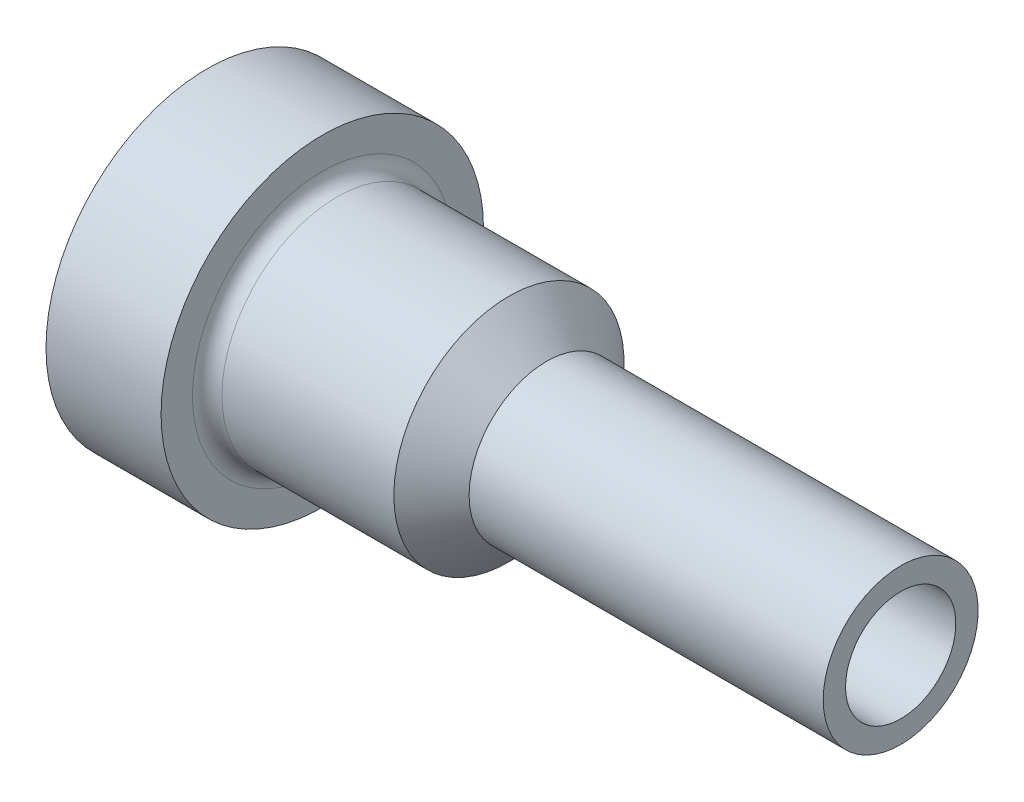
ISO-10303-21;
HEADER;
FILE_DESCRIPTION(('STEP AP214'),'2;1');
FILE_NAME('part.step','',(''),(''),'','','');
FILE_SCHEMA(('AUTOMOTIVE_DESIGN { 1 0 10303 214 1 1 1 1 }'));
ENDSEC;
DATA;
#1=APPLICATION_CONTEXT('core data for automotive mechanical design processes');
#2=APPLICATION_PROTOCOL_DEFINITION('international standard','automotive_design',2000,#1);
#3=PRODUCT_CONTEXT('',#1,'mechanical');
#4=PRODUCT('Part','Part','',(#3));
#5=PRODUCT_RELATED_PRODUCT_CATEGORY('part','',(#4));
#6=PRODUCT_DEFINITION_FORMATION('','',#4);
#7=PRODUCT_DEFINITION_CONTEXT('part definition',#1,'design');
#8=PRODUCT_DEFINITION('design','',#6,#7);
#9=PRODUCT_DEFINITION_SHAPE('','',#8);
#10=(LENGTH_UNIT() NAMED_UNIT(*) SI_UNIT(.MILLI.,.METRE.));
#11=(NAMED_UNIT(*) PLANE_ANGLE_UNIT() SI_UNIT($,.RADIAN.));
#12=(NAMED_UNIT(*) SI_UNIT($,.STERADIAN.) SOLID_ANGLE_UNIT());
#13=UNCERTAINTY_MEASURE_WITH_UNIT(LENGTH_MEASURE(1.E-05),#10,'distance_accuracy_value','');
#14=(GEOMETRIC_REPRESENTATION_CONTEXT(3) GLOBAL_UNCERTAINTY_ASSIGNED_CONTEXT((#13)) GLOBAL_UNIT_ASSIGNED_CONTEXT((#10,
#11,#12)) REPRESENTATION_CONTEXT('',''));
#15=CARTESIAN_POINT('',(0.,0.,0.));
#16=DIRECTION('',(0.,0.,1.));
#17=DIRECTION('',(1.,0.,0.));
#18=AXIS2_PLACEMENT_3D('',#15,#16,#17);
#19=CARTESIAN_POINT('',(23.876,0.,0.));
#20=DIRECTION('',(-1.,0.,0.));
#21=DIRECTION('',(0.,0.,1.));
#22=AXIS2_PLACEMENT_3D('',#19,#20,#21);
#23=CYLINDRICAL_SURFACE('',#22,5.5499);
#24=CARTESIAN_POINT('',(0.,0.,0.));
#25=DIRECTION('',(1.,0.,0.));
#26=DIRECTION('',(0.,0.,-1.));
#27=AXIS2_PLACEMENT_3D('',#24,#25,#26);
#28=CIRCLE('',#27,5.5499);
#29=CARTESIAN_POINT('',(0.,0.,-5.5499));
#30=VERTEX_POINT('',#29);
#31=EDGE_CURVE('E53',#30,#30,#28,.T.);
#32=ORIENTED_EDGE('',*,*,#31,.T.);
#33=EDGE_LOOP('',(#32));
#34=FACE_BOUND('',#33,.T.);
#35=CARTESIAN_POINT('',(3.9624,0.,0.));
#36=DIRECTION('',(-1.,0.,0.));
#37=DIRECTION('',(0.,0.,1.));
#38=AXIS2_PLACEMENT_3D('',#35,#36,#37);
#39=CIRCLE('',#38,5.5499);
#40=CARTESIAN_POINT('',(3.9624,0.,5.5499));
#41=VERTEX_POINT('',#40);
#42=EDGE_CURVE('E65',#41,#41,#39,.T.);
#43=ORIENTED_EDGE('',*,*,#42,.T.);
#44=EDGE_LOOP('',(#43));
#45=FACE_BOUND('',#44,.T.);
#46=ADVANCED_FACE('F33',(#34,#45),#23,.T.);
#47=CARTESIAN_POINT('',(0.,0.,0.));
#48=DIRECTION('',(1.,0.,0.));
#49=DIRECTION('',(0.,0.,-1.));
#50=AXIS2_PLACEMENT_3D('',#47,#48,#49);
#51=PLANE('',#50);
#52=CARTESIAN_POINT('',(0.,0.,0.));
#53=DIRECTION('',(1.,0.,0.));
#54=DIRECTION('',(0.,0.,-1.));
#55=AXIS2_PLACEMENT_3D('',#52,#53,#54);
#56=CIRCLE('',#55,2.66064999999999);
#57=CARTESIAN_POINT('',(0.,0.,-2.66064999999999));
#58=VERTEX_POINT('',#57);
#59=EDGE_CURVE('E44',#58,#58,#56,.T.);
#60=ORIENTED_EDGE('',*,*,#59,.T.);
#61=EDGE_LOOP('',(#60));
#62=FACE_BOUND('',#61,.T.);
#63=ORIENTED_EDGE('',*,*,#31,.F.);
#64=EDGE_LOOP('',(#63));
#65=FACE_BOUND('',#64,.T.);
#66=ADVANCED_FACE('F89',(#62,#65),#51,.F.);
#67=CARTESIAN_POINT('',(0.,0.,0.));
#68=DIRECTION('',(-1.,0.,0.));
#69=DIRECTION('',(0.,0.,1.));
#70=AXIS2_PLACEMENT_3D('',#67,#68,#69);
#71=CYLINDRICAL_SURFACE('',#70,2.667);
#72=CARTESIAN_POINT('',(23.876,0.,0.));
#73=DIRECTION('',(-1.,0.,0.));
#74=DIRECTION('',(0.,0.,1.));
#75=AXIS2_PLACEMENT_3D('',#72,#73,#74);
#76=CIRCLE('',#75,2.667);
#77=CARTESIAN_POINT('',(23.876,0.,2.667));
#78=VERTEX_POINT('',#77);
#79=EDGE_CURVE('E56',#78,#78,#76,.T.);
#80=ORIENTED_EDGE('',*,*,#79,.T.);
#81=EDGE_LOOP('',(#80));
#82=FACE_BOUND('',#81,.T.);
#83=CARTESIAN_POINT('',(11.684,0.,0.));
#84=DIRECTION('',(-1.,0.,0.));
#85=DIRECTION('',(0.,0.,1.));
#86=AXIS2_PLACEMENT_3D('',#83,#84,#85);
#87=CIRCLE('',#86,2.667);
#88=CARTESIAN_POINT('',(11.684,0.,2.667));
#89=VERTEX_POINT('',#88);
#90=EDGE_CURVE('E59',#89,#89,#87,.T.);
#91=ORIENTED_EDGE('',*,*,#90,.F.);
#92=EDGE_LOOP('',(#91));
#93=FACE_BOUND('',#92,.T.);
#94=ADVANCED_FACE('F95',(#82,#93),#71,.T.);
#95=CARTESIAN_POINT('',(10.3886,0.,0.));
#96=DIRECTION('',(-1.,0.,0.));
#97=DIRECTION('',(0.,0.,1.));
#98=AXIS2_PLACEMENT_3D('',#95,#96,#97);
#99=CONICAL_SURFACE('',#98,3.9624,0.78539816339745);
#100=ORIENTED_EDGE('',*,*,#90,.T.);
#101=EDGE_LOOP('',(#100));
#102=FACE_BOUND('',#101,.T.);
#103=CARTESIAN_POINT('',(10.3886,0.,0.));
#104=DIRECTION('',(-1.,0.,0.));
#105=DIRECTION('',(0.,0.,1.));
#106=AXIS2_PLACEMENT_3D('',#103,#104,#105);
#107=CIRCLE('',#106,3.9624);
#108=CARTESIAN_POINT('',(10.3886,0.,3.9624));
#109=VERTEX_POINT('',#108);
#110=EDGE_CURVE('E62',#109,#109,#107,.T.);
#111=ORIENTED_EDGE('',*,*,#110,.F.);
#112=EDGE_LOOP('',(#111));
#113=FACE_BOUND('',#112,.T.);
#114=ADVANCED_FACE('F102',(#102,#113),#99,.T.);
#115=CARTESIAN_POINT('',(0.,0.,0.));
#116=DIRECTION('',(-1.,0.,0.));
#117=DIRECTION('',(0.,0.,1.));
#118=AXIS2_PLACEMENT_3D('',#115,#116,#117);
#119=CYLINDRICAL_SURFACE('',#118,3.9624);
#120=CARTESIAN_POINT('',(4.4704,0.,0.));
#121=DIRECTION('',(1.,0.,0.));
#122=DIRECTION('',(0.,0.,-1.));
#123=AXIS2_PLACEMENT_3D('',#120,#121,#122);
#124=CIRCLE('',#123,3.9624);
#125=CARTESIAN_POINT('',(4.4704,0.,-3.9624));
#126=VERTEX_POINT('',#125);
#127=EDGE_CURVE('E10',#126,#126,#124,.T.);
#128=ORIENTED_EDGE('',*,*,#127,.T.);
#129=EDGE_LOOP('',(#128));
#130=FACE_BOUND('',#129,.T.);
#131=ORIENTED_EDGE('',*,*,#110,.T.);
#132=EDGE_LOOP('',(#131));
#133=FACE_BOUND('',#132,.T.);
#134=ADVANCED_FACE('F106',(#130,#133),#119,.T.);
#135=CARTESIAN_POINT('',(3.9624,5.5499,0.));
#136=DIRECTION('',(1.,0.,0.));
#137=DIRECTION('',(0.,0.,-1.));
#138=AXIS2_PLACEMENT_3D('',#135,#136,#137);
#139=PLANE('',#138);
#140=CARTESIAN_POINT('',(3.9624,0.,0.));
#141=DIRECTION('',(1.,0.,0.));
#142=DIRECTION('',(0.,0.,-1.));
#143=AXIS2_PLACEMENT_3D('',#140,#141,#142);
#144=CIRCLE('',#143,4.4704);
#145=CARTESIAN_POINT('',(3.9624,0.,-4.4704));
#146=VERTEX_POINT('',#145);
#147=EDGE_CURVE('E40',#146,#146,#144,.F.);
#148=ORIENTED_EDGE('',*,*,#147,.T.);
#149=EDGE_LOOP('',(#148));
#150=FACE_BOUND('',#149,.T.);
#151=ORIENTED_EDGE('',*,*,#42,.F.);
#152=EDGE_LOOP('',(#151));
#153=FACE_BOUND('',#152,.T.);
#154=ADVANCED_FACE('F85',(#150,#153),#139,.T.);
#155=CARTESIAN_POINT('',(23.876,0.,0.));
#156=DIRECTION('',(1.,0.,0.));
#157=DIRECTION('',(0.,0.,-1.));
#158=AXIS2_PLACEMENT_3D('',#155,#156,#157);
#159=PLANE('',#158);
#160=CARTESIAN_POINT('',(23.876,0.,0.));
#161=DIRECTION('',(-1.,0.,0.));
#162=DIRECTION('',(0.,0.,1.));
#163=AXIS2_PLACEMENT_3D('',#160,#161,#162);
#164=CIRCLE('',#163,1.89865);
#165=CARTESIAN_POINT('',(23.876,0.,1.89865));
#166=VERTEX_POINT('',#165);
#167=EDGE_CURVE('E68',#166,#166,#164,.T.);
#168=ORIENTED_EDGE('',*,*,#167,.T.);
#169=EDGE_LOOP('',(#168));
#170=FACE_BOUND('',#169,.T.);
#171=ORIENTED_EDGE('',*,*,#79,.F.);
#172=EDGE_LOOP('',(#171));
#173=FACE_BOUND('',#172,.T.);
#174=ADVANCED_FACE('F72',(#170,#173),#159,.T.);
#175=CARTESIAN_POINT('',(0.,0.,0.));
#176=DIRECTION('',(-1.,0.,0.));
#177=DIRECTION('',(0.,0.,1.));
#178=AXIS2_PLACEMENT_3D('',#175,#176,#177);
#179=CYLINDRICAL_SURFACE('',#178,1.89864999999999);
#180=CARTESIAN_POINT('',(0.686107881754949,0.,0.));
#181=DIRECTION('',(1.,0.,0.));
#182=DIRECTION('',(0.,0.,-1.));
#183=AXIS2_PLACEMENT_3D('',#180,#181,#182);
#184=CIRCLE('',#183,1.89864999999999);
#185=CARTESIAN_POINT('',(0.686107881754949,0.,-1.89864999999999));
#186=VERTEX_POINT('',#185);
#187=EDGE_CURVE('E48',#186,#186,#184,.F.);
#188=ORIENTED_EDGE('',*,*,#187,.T.);
#189=EDGE_LOOP('',(#188));
#190=FACE_BOUND('',#189,.T.);
#191=ORIENTED_EDGE('',*,*,#167,.F.);
#192=EDGE_LOOP('',(#191));
#193=FACE_BOUND('',#192,.T.);
#194=ADVANCED_FACE('F75',(#190,#193),#179,.F.);
#195=CARTESIAN_POINT('',(0.686107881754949,0.,0.));
#196=DIRECTION('',(-1.,0.,0.));
#197=DIRECTION('',(0.,0.,1.));
#198=AXIS2_PLACEMENT_3D('',#195,#196,#197);
#199=CONICAL_SURFACE('',#198,1.89864999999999,0.83775804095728);
#200=ORIENTED_EDGE('',*,*,#59,.F.);
#201=EDGE_LOOP('',(#200));
#202=FACE_BOUND('',#201,.T.);
#203=ORIENTED_EDGE('',*,*,#187,.F.);
#204=EDGE_LOOP('',(#203));
#205=FACE_BOUND('',#204,.T.);
#206=ADVANCED_FACE('F77',(#202,#205),#199,.F.);
#207=CARTESIAN_POINT('',(4.4704,0.,0.));
#208=DIRECTION('',(1.,0.,0.));
#209=DIRECTION('',(0.,0.,-1.));
#210=AXIS2_PLACEMENT_3D('',#207,#208,#209);
#211=TOROIDAL_SURFACE('',#210,4.4704,0.508);
#212=ORIENTED_EDGE('',*,*,#127,.F.);
#213=EDGE_LOOP('',(#212));
#214=FACE_BOUND('',#213,.T.);
#215=ORIENTED_EDGE('',*,*,#147,.F.);
#216=EDGE_LOOP('',(#215));
#217=FACE_BOUND('',#216,.T.);
#218=ADVANCED_FACE('F35',(#214,#217),#211,.F.);
#219=CLOSED_SHELL('',(#46,#66,#94,#114,#134,#154,#174,#194,#206,#218));
#220=MANIFOLD_SOLID_BREP('B2',#219);
#221=ADVANCED_BREP_SHAPE_REPRESENTATION('',(#18,#220),#14);
#222=SHAPE_DEFINITION_REPRESENTATION(#9,#221);
ENDSEC;
END-ISO-10303-21;
